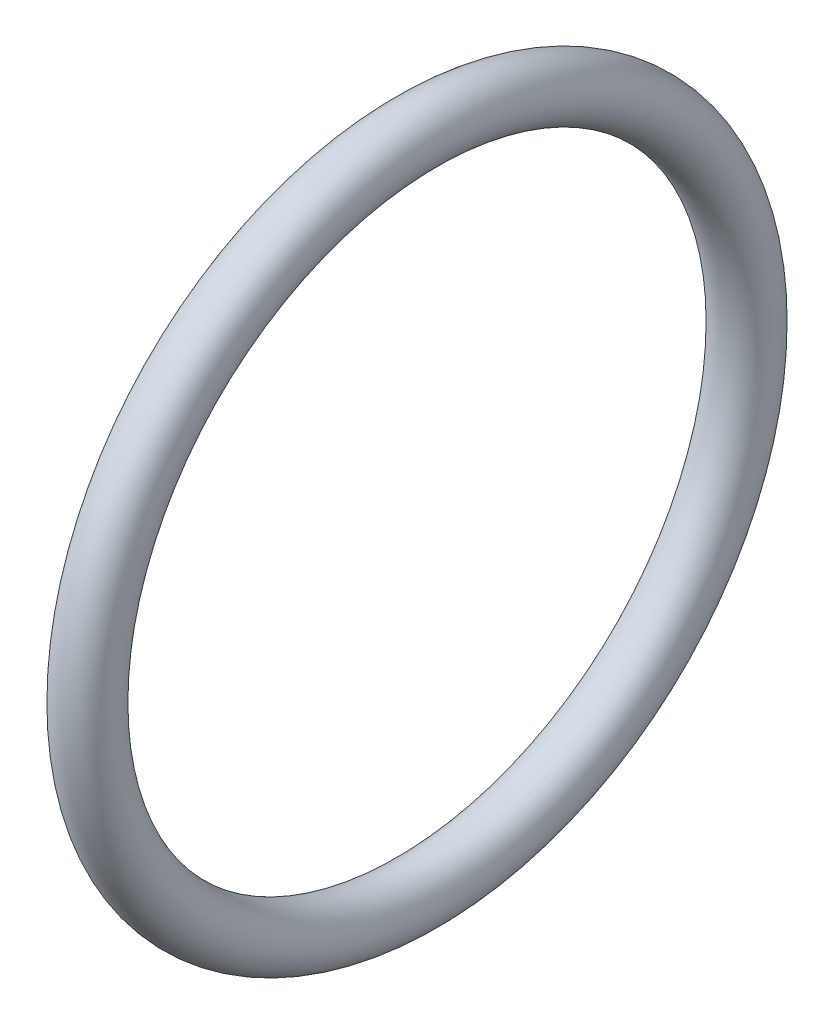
ISO-10303-21;
HEADER;
FILE_DESCRIPTION(('STEP AP214'),'2;1');
FILE_NAME('part.step','',(''),(''),'','','');
FILE_SCHEMA(('AUTOMOTIVE_DESIGN { 1 0 10303 214 1 1 1 1 }'));
ENDSEC;
DATA;
#1=APPLICATION_CONTEXT('core data for automotive mechanical design processes');
#2=APPLICATION_PROTOCOL_DEFINITION('international standard','automotive_design',2000,#1);
#3=PRODUCT_CONTEXT('',#1,'mechanical');
#4=PRODUCT('Part','Part','',(#3));
#5=PRODUCT_RELATED_PRODUCT_CATEGORY('part','',(#4));
#6=PRODUCT_DEFINITION_FORMATION('','',#4);
#7=PRODUCT_DEFINITION_CONTEXT('part definition',#1,'design');
#8=PRODUCT_DEFINITION('design','',#6,#7);
#9=PRODUCT_DEFINITION_SHAPE('','',#8);
#10=(LENGTH_UNIT() NAMED_UNIT(*) SI_UNIT(.MILLI.,.METRE.));
#11=(NAMED_UNIT(*) PLANE_ANGLE_UNIT() SI_UNIT($,.RADIAN.));
#12=(NAMED_UNIT(*) SI_UNIT($,.STERADIAN.) SOLID_ANGLE_UNIT());
#13=UNCERTAINTY_MEASURE_WITH_UNIT(LENGTH_MEASURE(1.E-05),#10,'distance_accuracy_value','');
#14=(GEOMETRIC_REPRESENTATION_CONTEXT(3) GLOBAL_UNCERTAINTY_ASSIGNED_CONTEXT((#13)) GLOBAL_UNIT_ASSIGNED_CONTEXT((#10,
#11,#12)) REPRESENTATION_CONTEXT('',''));
#15=CARTESIAN_POINT('',(0.,0.,0.));
#16=DIRECTION('',(0.,0.,1.));
#17=DIRECTION('',(1.,0.,0.));
#18=AXIS2_PLACEMENT_3D('',#15,#16,#17);
#19=CARTESIAN_POINT('',(1.143,0.,0.));
#20=DIRECTION('',(-1.,0.,0.));
#21=DIRECTION('',(0.,0.,1.));
#22=AXIS2_PLACEMENT_3D('',#19,#20,#21);
#23=TOROIDAL_SURFACE('',#22,13.1445,1.143);
#24=CARTESIAN_POINT('',(1.143,0.,14.2875));
#25=VERTEX_POINT('',#24);
#26=VERTEX_LOOP('',#25);
#27=FACE_BOUND('',#26,.T.);
#28=ADVANCED_FACE('F24',(#27),#23,.T.);
#29=CLOSED_SHELL('',(#28));
#30=MANIFOLD_SOLID_BREP('B2',#29);
#31=ADVANCED_BREP_SHAPE_REPRESENTATION('',(#18,#30),#14);
#32=SHAPE_DEFINITION_REPRESENTATION(#9,#31);
ENDSEC;
END-ISO-10303-21;
